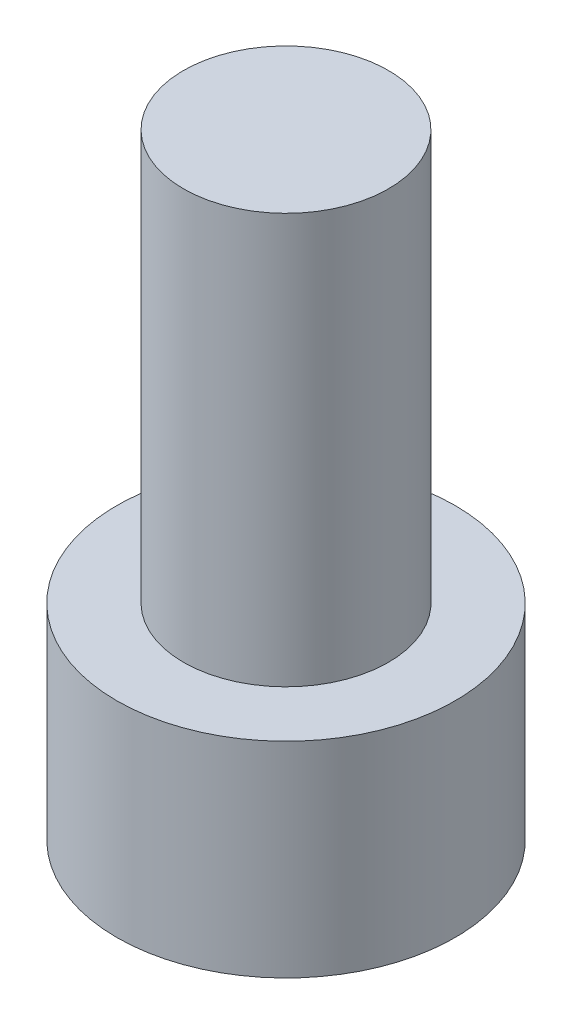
from build123d import *

# Parameters (mm, degrees)
SKETCH_1_R          = 6.6
EXTRUDE_1_DEPTH     = 8
SKETCH_2_R          = 4
EXTRUDE_2_DEPTH     = 16
CUT_EXTRUDE_1_DEPTH = 4


with BuildPart() as part:
    # Sketch 1 → Extrude 1 (new body)
    with BuildSketch(Plane(origin=(0, 0, 0), x_dir=(1, 0, 0), z_dir=(0, 1, 0))):
        with Locations(Location((0, 0, 0), (0, 0, 270))):
            Circle(SKETCH_1_R)
    extrude(amount=EXTRUDE_1_DEPTH)

    # Sketch 2 → Extrude 2 (add)
    with BuildSketch(Plane(origin=(0, 8, 0), x_dir=(1, 0, 0), z_dir=(0, 1, 0))):
        with Locations(Location((0, 0, 0), (0, 0, 270))):
            Circle(SKETCH_2_R)
    extrude(amount=EXTRUDE_2_DEPTH)

    # Sketch 3 → Cut-Extrude 1 (cut)
    with BuildSketch(Plane.XZ):
        Polygon((2.805209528, -2.032436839), (3.162746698, 1.413164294), (0.357537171, 3.445601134), (-2.805209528, 2.032436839), (-3.162746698, -1.413164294), (-0.357537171, -3.445601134), align=None)
    extrude(amount=-CUT_EXTRUDE_1_DEPTH, mode=Mode.SUBTRACT)


solid = part.part
